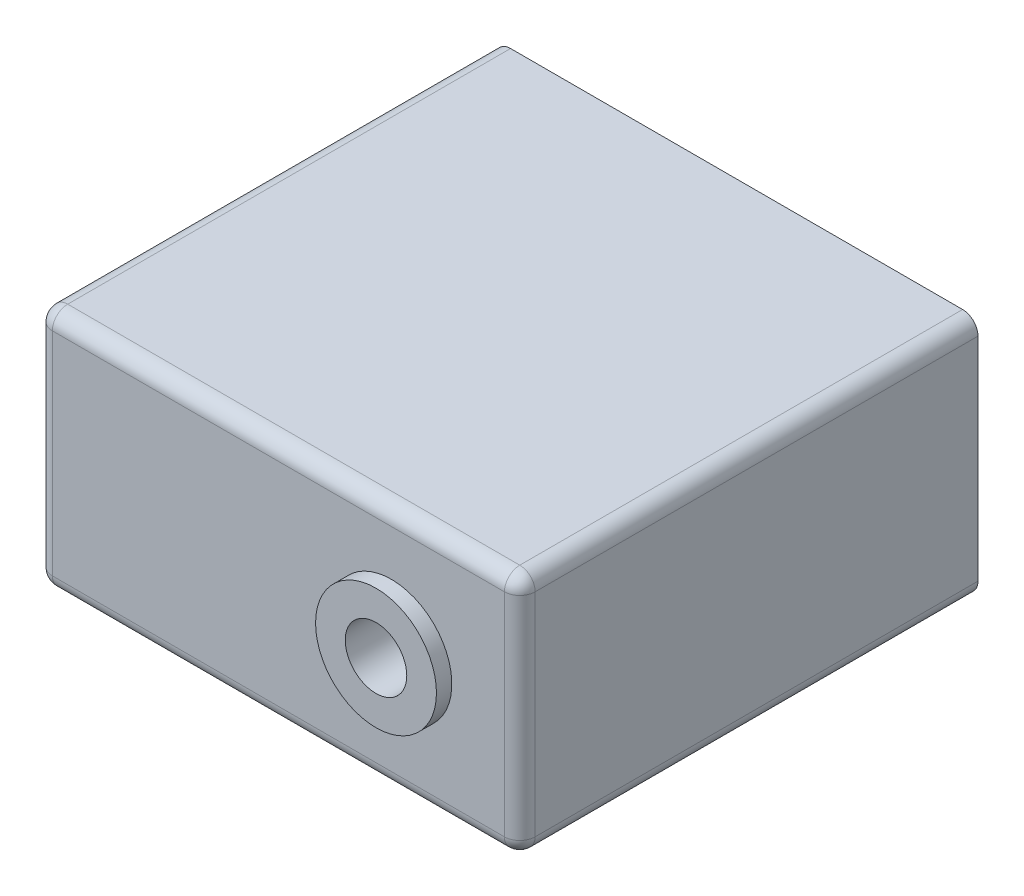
ISO-10303-21;
HEADER;
FILE_DESCRIPTION(('STEP AP214'),'2;1');
FILE_NAME('part.step','',(''),(''),'','','');
FILE_SCHEMA(('AUTOMOTIVE_DESIGN { 1 0 10303 214 1 1 1 1 }'));
ENDSEC;
DATA;
#1=APPLICATION_CONTEXT('core data for automotive mechanical design processes');
#2=APPLICATION_PROTOCOL_DEFINITION('international standard','automotive_design',2000,#1);
#3=PRODUCT_CONTEXT('',#1,'mechanical');
#4=PRODUCT('Part','Part','',(#3));
#5=PRODUCT_RELATED_PRODUCT_CATEGORY('part','',(#4));
#6=PRODUCT_DEFINITION_FORMATION('','',#4);
#7=PRODUCT_DEFINITION_CONTEXT('part definition',#1,'design');
#8=PRODUCT_DEFINITION('design','',#6,#7);
#9=PRODUCT_DEFINITION_SHAPE('','',#8);
#10=(LENGTH_UNIT() NAMED_UNIT(*) SI_UNIT(.MILLI.,.METRE.));
#11=(NAMED_UNIT(*) PLANE_ANGLE_UNIT() SI_UNIT($,.RADIAN.));
#12=(NAMED_UNIT(*) SI_UNIT($,.STERADIAN.) SOLID_ANGLE_UNIT());
#13=UNCERTAINTY_MEASURE_WITH_UNIT(LENGTH_MEASURE(1.E-05),#10,'distance_accuracy_value','');
#14=(GEOMETRIC_REPRESENTATION_CONTEXT(3) GLOBAL_UNCERTAINTY_ASSIGNED_CONTEXT((#13)) GLOBAL_UNIT_ASSIGNED_CONTEXT((#10,
#11,#12)) REPRESENTATION_CONTEXT('',''));
#15=CARTESIAN_POINT('',(0.,0.,0.));
#16=DIRECTION('',(0.,0.,1.));
#17=DIRECTION('',(1.,0.,0.));
#18=AXIS2_PLACEMENT_3D('',#15,#16,#17);
#19=CARTESIAN_POINT('',(0.,0.,37.846));
#20=DIRECTION('',(1.,0.,0.));
#21=DIRECTION('',(0.,0.,-1.));
#22=AXIS2_PLACEMENT_3D('',#19,#20,#21);
#23=PLANE('',#22);
#24=DIRECTION('',(0.,-1.,0.));
#25=VECTOR('',#24,1.);
#26=CARTESIAN_POINT('',(0.,0.,36.576));
#27=LINE('',#26,#25);
#28=CARTESIAN_POINT('',(0.,1.27,36.576));
#29=VERTEX_POINT('',#28);
#30=CARTESIAN_POINT('',(0.,18.796,36.576));
#31=VERTEX_POINT('',#30);
#32=EDGE_CURVE('E175',#29,#31,#27,.F.);
#33=ORIENTED_EDGE('',*,*,#32,.T.);
#34=DIRECTION('',(0.,0.,-1.));
#35=VECTOR('',#34,1.);
#36=CARTESIAN_POINT('',(0.,18.796,37.846));
#37=LINE('',#36,#35);
#38=CARTESIAN_POINT('',(0.,18.796,0.));
#39=VERTEX_POINT('',#38);
#40=EDGE_CURVE('E179',#31,#39,#37,.T.);
#41=ORIENTED_EDGE('',*,*,#40,.T.);
#42=DIRECTION('',(0.,-1.,0.));
#43=VECTOR('',#42,1.);
#44=CARTESIAN_POINT('',(0.,0.,0.));
#45=LINE('',#44,#43);
#46=CARTESIAN_POINT('',(0.,1.27,0.));
#47=VERTEX_POINT('',#46);
#48=EDGE_CURVE('E246',#39,#47,#45,.T.);
#49=ORIENTED_EDGE('',*,*,#48,.T.);
#50=DIRECTION('',(0.,0.,-1.));
#51=VECTOR('',#50,1.);
#52=CARTESIAN_POINT('',(0.,1.27,37.846));
#53=LINE('',#52,#51);
#54=EDGE_CURVE('E172',#47,#29,#53,.F.);
#55=ORIENTED_EDGE('',*,*,#54,.T.);
#56=EDGE_LOOP('',(#33,#41,#49,#55));
#57=FACE_BOUND('',#56,.T.);
#58=ADVANCED_FACE('F44',(#57),#23,.F.);
#59=CARTESIAN_POINT('',(0.,0.,37.846));
#60=DIRECTION('',(0.,1.,0.));
#61=DIRECTION('',(0.,0.,1.));
#62=AXIS2_PLACEMENT_3D('',#59,#60,#61);
#63=PLANE('',#62);
#64=DIRECTION('',(1.,0.,0.));
#65=VECTOR('',#64,1.);
#66=CARTESIAN_POINT('',(0.,0.,0.));
#67=LINE('',#66,#65);
#68=CARTESIAN_POINT('',(1.27,0.,0.));
#69=VERTEX_POINT('',#68);
#70=CARTESIAN_POINT('',(38.608,0.,0.));
#71=VERTEX_POINT('',#70);
#72=EDGE_CURVE('E249',#69,#71,#67,.T.);
#73=ORIENTED_EDGE('',*,*,#72,.T.);
#74=DIRECTION('',(0.,0.,-1.));
#75=VECTOR('',#74,1.);
#76=CARTESIAN_POINT('',(38.608,0.,37.846));
#77=LINE('',#76,#75);
#78=CARTESIAN_POINT('',(38.608,0.,36.576));
#79=VERTEX_POINT('',#78);
#80=EDGE_CURVE('E188',#71,#79,#77,.F.);
#81=ORIENTED_EDGE('',*,*,#80,.T.);
#82=DIRECTION('',(1.,0.,0.));
#83=VECTOR('',#82,1.);
#84=CARTESIAN_POINT('',(0.,0.,36.576));
#85=LINE('',#84,#83);
#86=CARTESIAN_POINT('',(1.27,0.,36.576));
#87=VERTEX_POINT('',#86);
#88=EDGE_CURVE('E185',#79,#87,#85,.F.);
#89=ORIENTED_EDGE('',*,*,#88,.T.);
#90=DIRECTION('',(0.,0.,-1.));
#91=VECTOR('',#90,1.);
#92=CARTESIAN_POINT('',(1.27,0.,37.846));
#93=LINE('',#92,#91);
#94=EDGE_CURVE('E182',#87,#69,#93,.T.);
#95=ORIENTED_EDGE('',*,*,#94,.T.);
#96=EDGE_LOOP('',(#73,#81,#89,#95));
#97=FACE_BOUND('',#96,.T.);
#98=ADVANCED_FACE('F302',(#97),#63,.F.);
#99=CARTESIAN_POINT('',(39.878,0.,37.846));
#100=DIRECTION('',(-1.,0.,0.));
#101=DIRECTION('',(0.,0.,1.));
#102=AXIS2_PLACEMENT_3D('',#99,#100,#101);
#103=PLANE('',#102);
#104=DIRECTION('',(0.,1.,0.));
#105=VECTOR('',#104,1.);
#106=CARTESIAN_POINT('',(39.878,0.,0.));
#107=LINE('',#106,#105);
#108=CARTESIAN_POINT('',(39.878,1.27,0.));
#109=VERTEX_POINT('',#108);
#110=CARTESIAN_POINT('',(39.878,18.796,0.));
#111=VERTEX_POINT('',#110);
#112=EDGE_CURVE('E163',#109,#111,#107,.T.);
#113=ORIENTED_EDGE('',*,*,#112,.T.);
#114=DIRECTION('',(0.,0.,-1.));
#115=VECTOR('',#114,1.);
#116=CARTESIAN_POINT('',(39.878,18.796,37.846));
#117=LINE('',#116,#115);
#118=CARTESIAN_POINT('',(39.878,18.796,36.576));
#119=VERTEX_POINT('',#118);
#120=EDGE_CURVE('E196',#111,#119,#117,.F.);
#121=ORIENTED_EDGE('',*,*,#120,.T.);
#122=DIRECTION('',(0.,1.,0.));
#123=VECTOR('',#122,1.);
#124=CARTESIAN_POINT('',(39.878,0.,36.576));
#125=LINE('',#124,#123);
#126=CARTESIAN_POINT('',(39.878,1.27,36.576));
#127=VERTEX_POINT('',#126);
#128=EDGE_CURVE('E139',#119,#127,#125,.F.);
#129=ORIENTED_EDGE('',*,*,#128,.T.);
#130=DIRECTION('',(0.,0.,-1.));
#131=VECTOR('',#130,1.);
#132=CARTESIAN_POINT('',(39.878,1.27,37.846));
#133=LINE('',#132,#131);
#134=EDGE_CURVE('E191',#127,#109,#133,.T.);
#135=ORIENTED_EDGE('',*,*,#134,.T.);
#136=EDGE_LOOP('',(#113,#121,#129,#135));
#137=FACE_BOUND('',#136,.T.);
#138=ADVANCED_FACE('F264',(#137),#103,.F.);
#139=CARTESIAN_POINT('',(0.,20.066,37.846));
#140=DIRECTION('',(0.,-1.,0.));
#141=DIRECTION('',(0.,0.,-1.));
#142=AXIS2_PLACEMENT_3D('',#139,#140,#141);
#143=PLANE('',#142);
#144=DIRECTION('',(-1.,0.,0.));
#145=VECTOR('',#144,1.);
#146=CARTESIAN_POINT('',(0.,20.066,36.576));
#147=LINE('',#146,#145);
#148=CARTESIAN_POINT('',(1.27,20.066,36.576));
#149=VERTEX_POINT('',#148);
#150=CARTESIAN_POINT('',(38.608,20.066,36.576));
#151=VERTEX_POINT('',#150);
#152=EDGE_CURVE('E60',#149,#151,#147,.F.);
#153=ORIENTED_EDGE('',*,*,#152,.T.);
#154=DIRECTION('',(0.,0.,-1.));
#155=VECTOR('',#154,1.);
#156=CARTESIAN_POINT('',(38.608,20.066,37.846));
#157=LINE('',#156,#155);
#158=CARTESIAN_POINT('',(38.608,20.066,0.));
#159=VERTEX_POINT('',#158);
#160=EDGE_CURVE('E203',#151,#159,#157,.T.);
#161=ORIENTED_EDGE('',*,*,#160,.T.);
#162=DIRECTION('',(-1.,0.,0.));
#163=VECTOR('',#162,1.);
#164=CARTESIAN_POINT('',(0.,20.066,0.));
#165=LINE('',#164,#163);
#166=CARTESIAN_POINT('',(1.27,20.066,0.));
#167=VERTEX_POINT('',#166);
#168=EDGE_CURVE('E160',#159,#167,#165,.T.);
#169=ORIENTED_EDGE('',*,*,#168,.T.);
#170=DIRECTION('',(0.,0.,-1.));
#171=VECTOR('',#170,1.);
#172=CARTESIAN_POINT('',(1.27,20.066,37.846));
#173=LINE('',#172,#171);
#174=EDGE_CURVE('E65',#167,#149,#173,.F.);
#175=ORIENTED_EDGE('',*,*,#174,.T.);
#176=EDGE_LOOP('',(#153,#161,#169,#175));
#177=FACE_BOUND('',#176,.T.);
#178=ADVANCED_FACE('F271',(#177),#143,.F.);
#179=CARTESIAN_POINT('',(0.,0.,37.846));
#180=DIRECTION('',(0.,0.,-1.));
#181=DIRECTION('',(-1.,0.,0.));
#182=AXIS2_PLACEMENT_3D('',#179,#180,#181);
#183=PLANE('',#182);
#184=CARTESIAN_POINT('',(29.2735,10.033,37.846));
#185=DIRECTION('',(0.,0.,-1.));
#186=DIRECTION('',(-1.,0.,0.));
#187=AXIS2_PLACEMENT_3D('',#184,#185,#186);
#188=CIRCLE('',#187,4.99118193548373);
#189=CARTESIAN_POINT('',(24.2823180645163,10.033,37.846));
#190=VERTEX_POINT('',#189);
#191=EDGE_CURVE('E11',#190,#190,#188,.F.);
#192=ORIENTED_EDGE('',*,*,#191,.F.);
#193=EDGE_LOOP('',(#192));
#194=FACE_BOUND('',#193,.T.);
#195=DIRECTION('',(-1.,0.,0.));
#196=VECTOR('',#195,1.);
#197=CARTESIAN_POINT('',(0.,18.796,37.846));
#198=LINE('',#197,#196);
#199=CARTESIAN_POINT('',(38.608,18.796,37.846));
#200=VERTEX_POINT('',#199);
#201=CARTESIAN_POINT('',(1.27,18.796,37.846));
#202=VERTEX_POINT('',#201);
#203=EDGE_CURVE('E125',#200,#202,#198,.T.);
#204=ORIENTED_EDGE('',*,*,#203,.T.);
#205=DIRECTION('',(0.,-1.,0.));
#206=VECTOR('',#205,1.);
#207=CARTESIAN_POINT('',(1.27,0.,37.846));
#208=LINE('',#207,#206);
#209=CARTESIAN_POINT('',(1.27,1.27,37.846));
#210=VERTEX_POINT('',#209);
#211=EDGE_CURVE('E169',#202,#210,#208,.T.);
#212=ORIENTED_EDGE('',*,*,#211,.T.);
#213=DIRECTION('',(1.,0.,0.));
#214=VECTOR('',#213,1.);
#215=CARTESIAN_POINT('',(0.,1.27,37.846));
#216=LINE('',#215,#214);
#217=CARTESIAN_POINT('',(38.608,1.27,37.846));
#218=VERTEX_POINT('',#217);
#219=EDGE_CURVE('E128',#210,#218,#216,.T.);
#220=ORIENTED_EDGE('',*,*,#219,.T.);
#221=DIRECTION('',(0.,1.,0.));
#222=VECTOR('',#221,1.);
#223=CARTESIAN_POINT('',(38.608,0.,37.846));
#224=LINE('',#223,#222);
#225=EDGE_CURVE('E120',#218,#200,#224,.T.);
#226=ORIENTED_EDGE('',*,*,#225,.T.);
#227=EDGE_LOOP('',(#204,#212,#220,#226));
#228=FACE_BOUND('',#227,.T.);
#229=ADVANCED_FACE('F122',(#194,#228),#183,.F.);
#230=CARTESIAN_POINT('',(0.,0.,0.));
#231=DIRECTION('',(0.,0.,-1.));
#232=DIRECTION('',(-1.,0.,0.));
#233=AXIS2_PLACEMENT_3D('',#230,#231,#232);
#234=PLANE('',#233);
#235=ORIENTED_EDGE('',*,*,#168,.F.);
#236=CARTESIAN_POINT('',(38.608,18.796,0.));
#237=DIRECTION('',(0.,0.,-1.));
#238=DIRECTION('',(-1.,0.,0.));
#239=AXIS2_PLACEMENT_3D('',#236,#237,#238);
#240=CIRCLE('',#239,1.27);
#241=EDGE_CURVE('E53',#159,#111,#240,.T.);
#242=ORIENTED_EDGE('',*,*,#241,.T.);
#243=ORIENTED_EDGE('',*,*,#112,.F.);
#244=CARTESIAN_POINT('',(38.608,1.27,0.));
#245=DIRECTION('',(0.,0.,-1.));
#246=DIRECTION('',(-1.,0.,0.));
#247=AXIS2_PLACEMENT_3D('',#244,#245,#246);
#248=CIRCLE('',#247,1.27);
#249=EDGE_CURVE('E209',#109,#71,#248,.T.);
#250=ORIENTED_EDGE('',*,*,#249,.T.);
#251=ORIENTED_EDGE('',*,*,#72,.F.);
#252=CARTESIAN_POINT('',(1.27,1.27,0.));
#253=DIRECTION('',(0.,0.,-1.));
#254=DIRECTION('',(-1.,0.,0.));
#255=AXIS2_PLACEMENT_3D('',#252,#253,#254);
#256=CIRCLE('',#255,1.27);
#257=EDGE_CURVE('E206',#69,#47,#256,.T.);
#258=ORIENTED_EDGE('',*,*,#257,.T.);
#259=ORIENTED_EDGE('',*,*,#48,.F.);
#260=CARTESIAN_POINT('',(1.27,18.796,0.));
#261=DIRECTION('',(0.,0.,-1.));
#262=DIRECTION('',(-1.,0.,0.));
#263=AXIS2_PLACEMENT_3D('',#260,#261,#262);
#264=CIRCLE('',#263,1.27);
#265=EDGE_CURVE('E212',#39,#167,#264,.T.);
#266=ORIENTED_EDGE('',*,*,#265,.T.);
#267=EDGE_LOOP('',(#235,#242,#243,#250,#251,#258,#259,#266));
#268=FACE_BOUND('',#267,.T.);
#269=ADVANCED_FACE('F272',(#268),#234,.T.);
#270=CARTESIAN_POINT('',(38.608,18.796,37.846));
#271=DIRECTION('',(0.,0.,-1.));
#272=DIRECTION('',(-1.,0.,0.));
#273=AXIS2_PLACEMENT_3D('',#270,#271,#272);
#274=CYLINDRICAL_SURFACE('',#273,1.27);
#275=ORIENTED_EDGE('',*,*,#241,.F.);
#276=ORIENTED_EDGE('',*,*,#160,.F.);
#277=CARTESIAN_POINT('',(38.608,18.796,36.576));
#278=DIRECTION('',(0.,0.,1.));
#279=DIRECTION('',(1.,0.,0.));
#280=AXIS2_PLACEMENT_3D('',#277,#278,#279);
#281=CIRCLE('',#280,1.27);
#282=EDGE_CURVE('E144',#119,#151,#281,.T.);
#283=ORIENTED_EDGE('',*,*,#282,.F.);
#284=ORIENTED_EDGE('',*,*,#120,.F.);
#285=EDGE_LOOP('',(#275,#276,#283,#284));
#286=FACE_BOUND('',#285,.T.);
#287=ADVANCED_FACE('F46',(#286),#274,.T.);
#288=CARTESIAN_POINT('',(38.608,0.,36.576));
#289=DIRECTION('',(0.,1.,0.));
#290=DIRECTION('',(0.,0.,1.));
#291=AXIS2_PLACEMENT_3D('',#288,#289,#290);
#292=CYLINDRICAL_SURFACE('',#291,1.27);
#293=CARTESIAN_POINT('',(38.608,1.27,36.576));
#294=DIRECTION('',(0.,-1.,0.));
#295=DIRECTION('',(0.,0.,-1.));
#296=AXIS2_PLACEMENT_3D('',#293,#294,#295);
#297=CIRCLE('',#296,1.27);
#298=EDGE_CURVE('E145',#127,#218,#297,.T.);
#299=ORIENTED_EDGE('',*,*,#298,.F.);
#300=ORIENTED_EDGE('',*,*,#128,.F.);
#301=CARTESIAN_POINT('',(38.608,18.796,36.576));
#302=DIRECTION('',(0.,1.,0.));
#303=DIRECTION('',(0.,0.,1.));
#304=AXIS2_PLACEMENT_3D('',#301,#302,#303);
#305=CIRCLE('',#304,1.27);
#306=EDGE_CURVE('E136',#200,#119,#305,.T.);
#307=ORIENTED_EDGE('',*,*,#306,.F.);
#308=ORIENTED_EDGE('',*,*,#225,.F.);
#309=EDGE_LOOP('',(#299,#300,#307,#308));
#310=FACE_BOUND('',#309,.T.);
#311=ADVANCED_FACE('F138',(#310),#292,.T.);
#312=CARTESIAN_POINT('',(38.608,1.27,37.846));
#313=DIRECTION('',(0.,0.,-1.));
#314=DIRECTION('',(-1.,0.,0.));
#315=AXIS2_PLACEMENT_3D('',#312,#313,#314);
#316=CYLINDRICAL_SURFACE('',#315,1.27);
#317=ORIENTED_EDGE('',*,*,#249,.F.);
#318=ORIENTED_EDGE('',*,*,#134,.F.);
#319=CARTESIAN_POINT('',(38.608,1.27,36.576));
#320=DIRECTION('',(0.,0.,1.));
#321=DIRECTION('',(1.,0.,0.));
#322=AXIS2_PLACEMENT_3D('',#319,#320,#321);
#323=CIRCLE('',#322,1.27);
#324=EDGE_CURVE('E152',#79,#127,#323,.T.);
#325=ORIENTED_EDGE('',*,*,#324,.F.);
#326=ORIENTED_EDGE('',*,*,#80,.F.);
#327=EDGE_LOOP('',(#317,#318,#325,#326));
#328=FACE_BOUND('',#327,.T.);
#329=ADVANCED_FACE('F298',(#328),#316,.T.);
#330=CARTESIAN_POINT('',(38.608,18.796,36.576));
#331=DIRECTION('',(1.,0.,0.));
#332=DIRECTION('',(0.,0.,-1.));
#333=AXIS2_PLACEMENT_3D('',#330,#331,#332);
#334=SPHERICAL_SURFACE('',#333,1.27);
#335=ORIENTED_EDGE('',*,*,#306,.T.);
#336=ORIENTED_EDGE('',*,*,#282,.T.);
#337=CARTESIAN_POINT('',(38.608,18.796,36.576));
#338=DIRECTION('',(1.,0.,0.));
#339=DIRECTION('',(0.,0.,-1.));
#340=AXIS2_PLACEMENT_3D('',#337,#338,#339);
#341=CIRCLE('',#340,1.27);
#342=EDGE_CURVE('E148',#200,#151,#341,.F.);
#343=ORIENTED_EDGE('',*,*,#342,.F.);
#344=EDGE_LOOP('',(#335,#336,#343));
#345=FACE_BOUND('',#344,.T.);
#346=ADVANCED_FACE('F149',(#345),#334,.T.);
#347=CARTESIAN_POINT('',(38.608,1.27,36.576));
#348=DIRECTION('',(1.,0.,0.));
#349=DIRECTION('',(0.,0.,-1.));
#350=AXIS2_PLACEMENT_3D('',#347,#348,#349);
#351=SPHERICAL_SURFACE('',#350,1.27);
#352=ORIENTED_EDGE('',*,*,#324,.T.);
#353=ORIENTED_EDGE('',*,*,#298,.T.);
#354=CARTESIAN_POINT('',(38.608,1.27,36.576));
#355=DIRECTION('',(1.,0.,0.));
#356=DIRECTION('',(0.,0.,-1.));
#357=AXIS2_PLACEMENT_3D('',#354,#355,#356);
#358=CIRCLE('',#357,1.27);
#359=EDGE_CURVE('E153',#79,#218,#358,.F.);
#360=ORIENTED_EDGE('',*,*,#359,.F.);
#361=EDGE_LOOP('',(#352,#353,#360));
#362=FACE_BOUND('',#361,.T.);
#363=ADVANCED_FACE('F294',(#362),#351,.T.);
#364=CARTESIAN_POINT('',(1.27,18.796,37.846));
#365=DIRECTION('',(0.,0.,-1.));
#366=DIRECTION('',(-1.,0.,0.));
#367=AXIS2_PLACEMENT_3D('',#364,#365,#366);
#368=CYLINDRICAL_SURFACE('',#367,1.27);
#369=ORIENTED_EDGE('',*,*,#265,.F.);
#370=ORIENTED_EDGE('',*,*,#40,.F.);
#371=CARTESIAN_POINT('',(1.27,18.796,36.576));
#372=DIRECTION('',(0.,0.,1.));
#373=DIRECTION('',(1.,0.,0.));
#374=AXIS2_PLACEMENT_3D('',#371,#372,#373);
#375=CIRCLE('',#374,1.27);
#376=EDGE_CURVE('E234',#149,#31,#375,.T.);
#377=ORIENTED_EDGE('',*,*,#376,.F.);
#378=ORIENTED_EDGE('',*,*,#174,.F.);
#379=EDGE_LOOP('',(#369,#370,#377,#378));
#380=FACE_BOUND('',#379,.T.);
#381=ADVANCED_FACE('F276',(#380),#368,.T.);
#382=CARTESIAN_POINT('',(0.,18.796,36.576));
#383=DIRECTION('',(-1.,0.,0.));
#384=DIRECTION('',(0.,0.,1.));
#385=AXIS2_PLACEMENT_3D('',#382,#383,#384);
#386=CYLINDRICAL_SURFACE('',#385,1.27);
#387=ORIENTED_EDGE('',*,*,#342,.T.);
#388=ORIENTED_EDGE('',*,*,#152,.F.);
#389=CARTESIAN_POINT('',(1.27,18.796,36.576));
#390=DIRECTION('',(-1.,0.,0.));
#391=DIRECTION('',(0.,0.,1.));
#392=AXIS2_PLACEMENT_3D('',#389,#390,#391);
#393=CIRCLE('',#392,1.27);
#394=EDGE_CURVE('E157',#202,#149,#393,.T.);
#395=ORIENTED_EDGE('',*,*,#394,.F.);
#396=ORIENTED_EDGE('',*,*,#203,.F.);
#397=EDGE_LOOP('',(#387,#388,#395,#396));
#398=FACE_BOUND('',#397,.T.);
#399=ADVANCED_FACE('F155',(#398),#386,.T.);
#400=CARTESIAN_POINT('',(0.,1.27,36.576));
#401=DIRECTION('',(1.,0.,0.));
#402=DIRECTION('',(0.,0.,-1.));
#403=AXIS2_PLACEMENT_3D('',#400,#401,#402);
#404=CYLINDRICAL_SURFACE('',#403,1.27);
#405=ORIENTED_EDGE('',*,*,#359,.T.);
#406=ORIENTED_EDGE('',*,*,#219,.F.);
#407=CARTESIAN_POINT('',(1.27,1.27,36.576));
#408=DIRECTION('',(-1.,0.,0.));
#409=DIRECTION('',(0.,0.,1.));
#410=AXIS2_PLACEMENT_3D('',#407,#408,#409);
#411=CIRCLE('',#410,1.27);
#412=EDGE_CURVE('E228',#87,#210,#411,.T.);
#413=ORIENTED_EDGE('',*,*,#412,.F.);
#414=ORIENTED_EDGE('',*,*,#88,.F.);
#415=EDGE_LOOP('',(#405,#406,#413,#414));
#416=FACE_BOUND('',#415,.T.);
#417=ADVANCED_FACE('F291',(#416),#404,.T.);
#418=CARTESIAN_POINT('',(1.27,1.27,37.846));
#419=DIRECTION('',(0.,0.,-1.));
#420=DIRECTION('',(-1.,0.,0.));
#421=AXIS2_PLACEMENT_3D('',#418,#419,#420);
#422=CYLINDRICAL_SURFACE('',#421,1.27);
#423=ORIENTED_EDGE('',*,*,#257,.F.);
#424=ORIENTED_EDGE('',*,*,#94,.F.);
#425=CARTESIAN_POINT('',(1.27,1.27,36.576));
#426=DIRECTION('',(0.,0.,1.));
#427=DIRECTION('',(1.,0.,0.));
#428=AXIS2_PLACEMENT_3D('',#425,#426,#427);
#429=CIRCLE('',#428,1.27);
#430=EDGE_CURVE('E224',#29,#87,#429,.T.);
#431=ORIENTED_EDGE('',*,*,#430,.F.);
#432=ORIENTED_EDGE('',*,*,#54,.F.);
#433=EDGE_LOOP('',(#423,#424,#431,#432));
#434=FACE_BOUND('',#433,.T.);
#435=ADVANCED_FACE('F305',(#434),#422,.T.);
#436=CARTESIAN_POINT('',(1.27,18.796,36.576));
#437=DIRECTION('',(0.,1.,0.));
#438=DIRECTION('',(0.,0.,1.));
#439=AXIS2_PLACEMENT_3D('',#436,#437,#438);
#440=SPHERICAL_SURFACE('',#439,1.27);
#441=ORIENTED_EDGE('',*,*,#394,.T.);
#442=ORIENTED_EDGE('',*,*,#376,.T.);
#443=CARTESIAN_POINT('',(1.27,18.796,36.576));
#444=DIRECTION('',(0.,1.,0.));
#445=DIRECTION('',(0.,0.,1.));
#446=AXIS2_PLACEMENT_3D('',#443,#444,#445);
#447=CIRCLE('',#446,1.27);
#448=EDGE_CURVE('E220',#202,#31,#447,.F.);
#449=ORIENTED_EDGE('',*,*,#448,.F.);
#450=EDGE_LOOP('',(#441,#442,#449));
#451=FACE_BOUND('',#450,.T.);
#452=ADVANCED_FACE('F279',(#451),#440,.T.);
#453=CARTESIAN_POINT('',(1.27,1.27,36.576));
#454=DIRECTION('',(0.,-1.,0.));
#455=DIRECTION('',(0.,0.,-1.));
#456=AXIS2_PLACEMENT_3D('',#453,#454,#455);
#457=SPHERICAL_SURFACE('',#456,1.27);
#458=ORIENTED_EDGE('',*,*,#430,.T.);
#459=ORIENTED_EDGE('',*,*,#412,.T.);
#460=CARTESIAN_POINT('',(1.27,1.27,36.576));
#461=DIRECTION('',(0.,-1.,0.));
#462=DIRECTION('',(0.,0.,-1.));
#463=AXIS2_PLACEMENT_3D('',#460,#461,#462);
#464=CIRCLE('',#463,1.27);
#465=EDGE_CURVE('E217',#29,#210,#464,.F.);
#466=ORIENTED_EDGE('',*,*,#465,.F.);
#467=EDGE_LOOP('',(#458,#459,#466));
#468=FACE_BOUND('',#467,.T.);
#469=ADVANCED_FACE('F287',(#468),#457,.T.);
#470=CARTESIAN_POINT('',(1.27,0.,36.576));
#471=DIRECTION('',(0.,-1.,0.));
#472=DIRECTION('',(0.,0.,-1.));
#473=AXIS2_PLACEMENT_3D('',#470,#471,#472);
#474=CYLINDRICAL_SURFACE('',#473,1.27);
#475=ORIENTED_EDGE('',*,*,#448,.T.);
#476=ORIENTED_EDGE('',*,*,#32,.F.);
#477=ORIENTED_EDGE('',*,*,#465,.T.);
#478=ORIENTED_EDGE('',*,*,#211,.F.);
#479=EDGE_LOOP('',(#475,#476,#477,#478));
#480=FACE_BOUND('',#479,.T.);
#481=ADVANCED_FACE('F283',(#480),#474,.T.);
#482=CARTESIAN_POINT('',(29.2735,10.033,39.116));
#483=DIRECTION('',(0.,0.,-1.));
#484=DIRECTION('',(-1.,0.,0.));
#485=AXIS2_PLACEMENT_3D('',#482,#483,#484);
#486=CYLINDRICAL_SURFACE('',#485,4.99118193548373);
#487=CARTESIAN_POINT('',(29.2735,10.033,39.116));
#488=DIRECTION('',(0.,0.,1.));
#489=DIRECTION('',(1.,0.,0.));
#490=AXIS2_PLACEMENT_3D('',#487,#488,#489);
#491=CIRCLE('',#490,4.99118193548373);
#492=CARTESIAN_POINT('',(34.2646819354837,10.033,39.116));
#493=VERTEX_POINT('',#492);
#494=EDGE_CURVE('E221',#493,#493,#491,.T.);
#495=ORIENTED_EDGE('',*,*,#494,.F.);
#496=EDGE_LOOP('',(#495));
#497=FACE_BOUND('',#496,.T.);
#498=ORIENTED_EDGE('',*,*,#191,.T.);
#499=EDGE_LOOP('',(#498));
#500=FACE_BOUND('',#499,.T.);
#501=ADVANCED_FACE('F316',(#497,#500),#486,.T.);
#502=CARTESIAN_POINT('',(29.2735,10.033,39.116));
#503=DIRECTION('',(0.,0.,1.));
#504=DIRECTION('',(1.,0.,0.));
#505=AXIS2_PLACEMENT_3D('',#502,#503,#504);
#506=PLANE('',#505);
#507=CARTESIAN_POINT('',(29.2735,10.033,39.116));
#508=DIRECTION('',(0.,0.,1.));
#509=DIRECTION('',(1.,0.,0.));
#510=AXIS2_PLACEMENT_3D('',#507,#508,#509);
#511=CIRCLE('',#510,2.54);
#512=CARTESIAN_POINT('',(31.8135,10.033,39.116));
#513=VERTEX_POINT('',#512);
#514=EDGE_CURVE('E484',#513,#513,#511,.T.);
#515=ORIENTED_EDGE('',*,*,#514,.F.);
#516=EDGE_LOOP('',(#515));
#517=FACE_BOUND('',#516,.T.);
#518=ORIENTED_EDGE('',*,*,#494,.T.);
#519=EDGE_LOOP('',(#518));
#520=FACE_BOUND('',#519,.T.);
#521=ADVANCED_FACE('F448',(#517,#520),#506,.T.);
#522=CARTESIAN_POINT('',(29.2735,10.033,34.036));
#523=DIRECTION('',(0.,0.,1.));
#524=DIRECTION('',(1.,0.,0.));
#525=AXIS2_PLACEMENT_3D('',#522,#523,#524);
#526=CYLINDRICAL_SURFACE('',#525,2.54);
#527=CARTESIAN_POINT('',(29.2735,10.033,34.036));
#528=DIRECTION('',(0.,0.,1.));
#529=DIRECTION('',(1.,0.,0.));
#530=AXIS2_PLACEMENT_3D('',#527,#528,#529);
#531=CIRCLE('',#530,2.54);
#532=CARTESIAN_POINT('',(31.8135,10.033,34.036));
#533=VERTEX_POINT('',#532);
#534=EDGE_CURVE('E482',#533,#533,#531,.T.);
#535=ORIENTED_EDGE('',*,*,#534,.F.);
#536=EDGE_LOOP('',(#535));
#537=FACE_BOUND('',#536,.T.);
#538=ORIENTED_EDGE('',*,*,#514,.T.);
#539=EDGE_LOOP('',(#538));
#540=FACE_BOUND('',#539,.T.);
#541=ADVANCED_FACE('F457',(#537,#540),#526,.F.);
#542=CARTESIAN_POINT('',(29.2735,10.033,34.036));
#543=DIRECTION('',(0.,0.,1.));
#544=DIRECTION('',(1.,0.,0.));
#545=AXIS2_PLACEMENT_3D('',#542,#543,#544);
#546=PLANE('',#545);
#547=ORIENTED_EDGE('',*,*,#534,.T.);
#548=EDGE_LOOP('',(#547));
#549=FACE_BOUND('',#548,.T.);
#550=ADVANCED_FACE('F467',(#549),#546,.T.);
#551=CLOSED_SHELL('',(#58,#98,#138,#178,#229,#269,#287,#311,#329,#346,#363,#381,#399,#417,#435,
#452,#469,#481,#501,#521,#541,#550));
#552=MANIFOLD_SOLID_BREP('B2',#551);
#553=ADVANCED_BREP_SHAPE_REPRESENTATION('',(#18,#552),#14);
#554=SHAPE_DEFINITION_REPRESENTATION(#9,#553);
ENDSEC;
END-ISO-10303-21;
